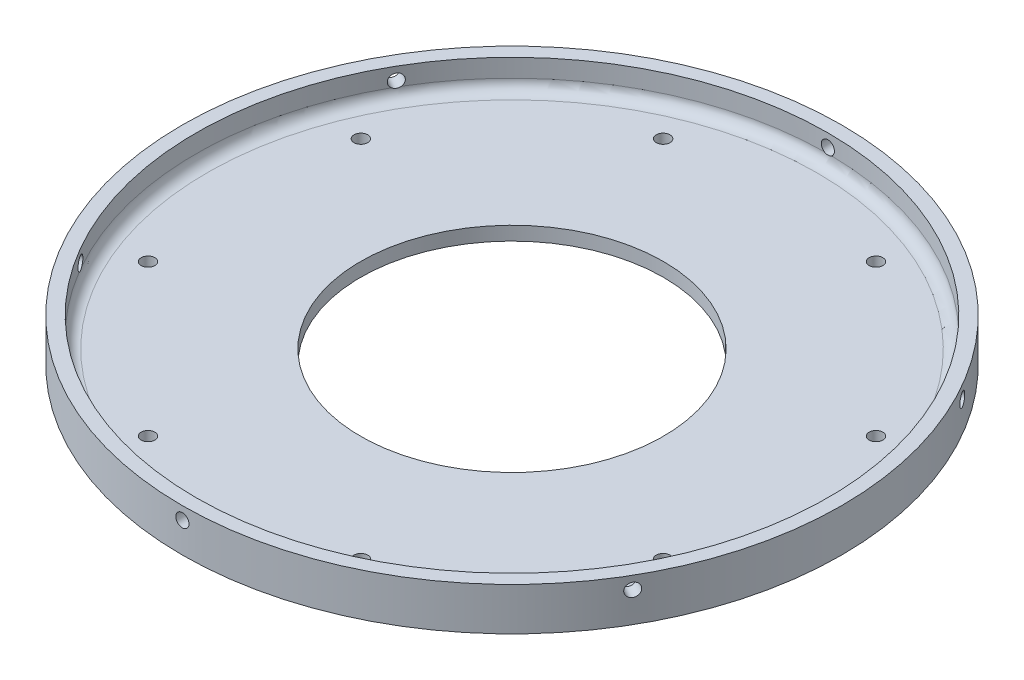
from build123d import *

# Parameters (mm, degrees)
FILLET1_R                    = 2.54
SKETCH10_W                   = 1.524
SKETCH10_H                   = 104.091135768
CIRPATTERN1_COUNT            = 6
F_1_8_0_125_DIAMETER_HOLE1_D = 3.175


with BuildPart() as part:
    # Sketch5 → Revolve1 (revolve)
    with BuildSketch(Plane.XY, mode=Mode.PRIVATE) as revolve1_sk:
        Polygon((-35, 0), (-76.2, 0), (-76.2, 9.9), (-73.025, 9.9), (-73.025, 3.175), (-35, 3.175), align=None)
    revolve(revolve1_sk.sketch.rotate(Axis((0, -81.091216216, 0), (0, 1, 0)), 270), axis=Axis((0, -81.091216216, 0), (0, 1, 0)))

    # Fillet1
    fillet1_edges = [part.edges().sort_by_distance(p)[0] for p in [
        (0, 3.175, 73.025),
    ]]
    fillet(fillet1_edges, radius=FILLET1_R)

    # Sketch10 → 31 _0.12_ Diameter Hole1 (revolve, cut)
    with BuildSketch(Plane(origin=(0.010273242, 6.985, 0), x_dir=(0, 1, 0), z_dir=(1, 0, 0))):
        with Locations((0.762, 52.045567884)):
            Rectangle(SKETCH10_W, SKETCH10_H)
    f_31_0_12_diameter_hole1 = revolve(axis=Axis((0.010273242, 6.985, -6.35), (0, 0, 1)), mode=Mode.SUBTRACT)

    # CirPattern1: 31 _0.12_ Diameter Hole1 ×6 about axis
    cirpattern1_axis = Axis((0, -81.091216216, 0), (0, -1, 0))
    for i in range(1, CIRPATTERN1_COUNT):
        add(f_31_0_12_diameter_hole1.rotate(cirpattern1_axis, i * 360 / CIRPATTERN1_COUNT), mode=Mode.SUBTRACT)

    # 1_8 _0.125_ Diameter Hole1 (through all)
    with Locations(Plane.XZ):
        with Locations((-24.6, -59.525), (24.6, -59.525), (-59.525, -24.6), (-59.525, 24.6), (-24.6, 59.525), (24.6, 59.525), (59.525, 24.6), (59.525, -24.6)):
            Hole(F_1_8_0_125_DIAMETER_HOLE1_D / 2)


solid = part.part
